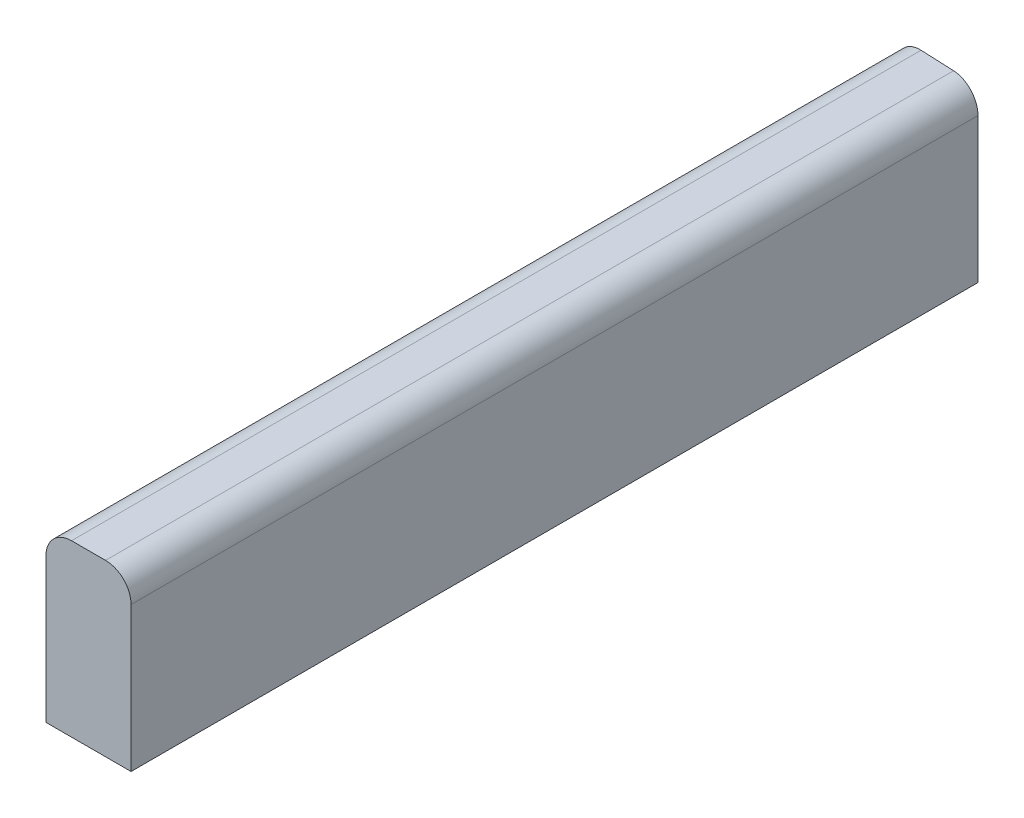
from build123d import *

# Parameters (mm, degrees)
LINEAR_AUSTRAGEN1_DEPTH         = 100
SCHNITT_LINEAR_AUSTRAGEN1_DEPTH = 103.46950766


with BuildPart() as part:
    # Skizze1 → Linear austragen1 (new body)
    with BuildSketch(Plane.XY):
        with BuildLine():
            Line((0, 0), (10, 0))
            Line((10, 0), (10, 17))
            ThreePointArc((10, 17), (9.121320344, 19.121320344), (7, 20))
            Line((7, 20), (3, 20))
            ThreePointArc((3, 20), (0.878679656, 19.121320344), (0, 17))
            Line((0, 17), (0, 0))
        make_face()
    extrude(amount=LINEAR_AUSTRAGEN1_DEPTH)

    # Skizze2 → Schnitt-Linear austragen1 (cut, through all)
    with BuildSketch(Plane(origin=(0, 20, 0), x_dir=(1, 0, 0), z_dir=(0, 1, 0))):
        Polygon((0, 0), (10, -0.436609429), (10, 0), align=None)
    extrude(amount=-SCHNITT_LINEAR_AUSTRAGEN1_DEPTH, mode=Mode.SUBTRACT)


solid = part.part
